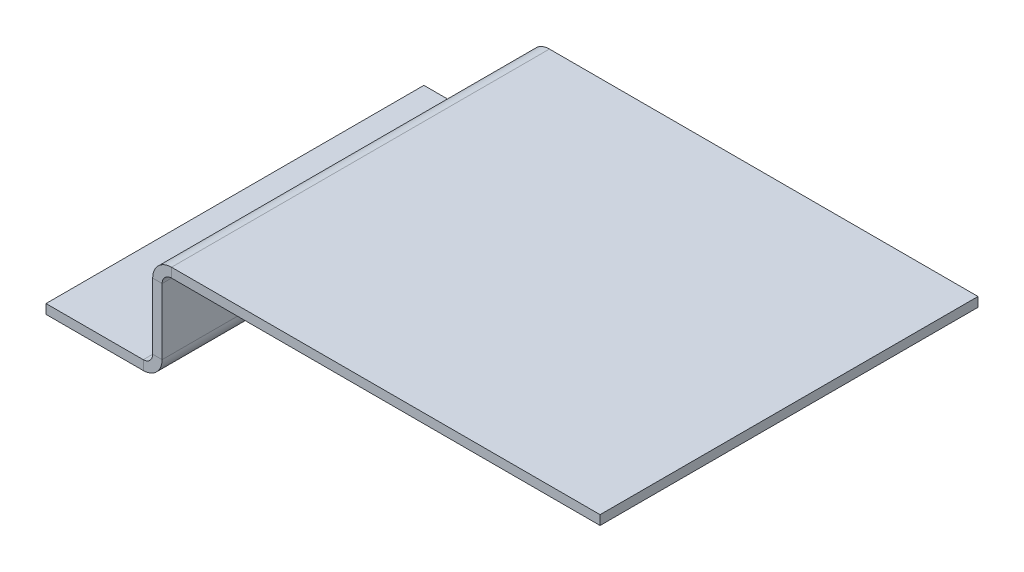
ISO-10303-21;
HEADER;
FILE_DESCRIPTION(('STEP AP214'),'2;1');
FILE_NAME('part.step','',(''),(''),'','','');
FILE_SCHEMA(('AUTOMOTIVE_DESIGN { 1 0 10303 214 1 1 1 1 }'));
ENDSEC;
DATA;
#1=APPLICATION_CONTEXT('core data for automotive mechanical design processes');
#2=APPLICATION_PROTOCOL_DEFINITION('international standard','automotive_design',2000,#1);
#3=PRODUCT_CONTEXT('',#1,'mechanical');
#4=PRODUCT('Part','Part','',(#3));
#5=PRODUCT_RELATED_PRODUCT_CATEGORY('part','',(#4));
#6=PRODUCT_DEFINITION_FORMATION('','',#4);
#7=PRODUCT_DEFINITION_CONTEXT('part definition',#1,'design');
#8=PRODUCT_DEFINITION('design','',#6,#7);
#9=PRODUCT_DEFINITION_SHAPE('','',#8);
#10=(LENGTH_UNIT() NAMED_UNIT(*) SI_UNIT(.MILLI.,.METRE.));
#11=(NAMED_UNIT(*) PLANE_ANGLE_UNIT() SI_UNIT($,.RADIAN.));
#12=(NAMED_UNIT(*) SI_UNIT($,.STERADIAN.) SOLID_ANGLE_UNIT());
#13=UNCERTAINTY_MEASURE_WITH_UNIT(LENGTH_MEASURE(1.E-05),#10,'distance_accuracy_value','');
#14=(GEOMETRIC_REPRESENTATION_CONTEXT(3) GLOBAL_UNCERTAINTY_ASSIGNED_CONTEXT((#13)) GLOBAL_UNIT_ASSIGNED_CONTEXT((#10,
#11,#12)) REPRESENTATION_CONTEXT('',''));
#15=CARTESIAN_POINT('',(0.,0.,0.));
#16=DIRECTION('',(0.,0.,1.));
#17=DIRECTION('',(1.,0.,0.));
#18=AXIS2_PLACEMENT_3D('',#15,#16,#17);
#19=CARTESIAN_POINT('',(24.6513405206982,-21.3637295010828,-80.2293172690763));
#20=DIRECTION('',(1.,0.,0.));
#21=DIRECTION('',(0.,0.,-1.));
#22=AXIS2_PLACEMENT_3D('',#19,#20,#21);
#23=PLANE('',#22);
#24=DIRECTION('',(0.,-1.,0.));
#25=VECTOR('',#24,1.);
#26=CARTESIAN_POINT('',(24.6513405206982,-21.3637295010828,-80.2293172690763));
#27=LINE('',#26,#25);
#28=CARTESIAN_POINT('',(24.6513405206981,18.,-80.2293172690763));
#29=VERTEX_POINT('',#28);
#30=CARTESIAN_POINT('',(24.6513405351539,4.00000000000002,-80.2293172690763));
#31=VERTEX_POINT('',#30);
#32=EDGE_CURVE('E56',#29,#31,#27,.T.);
#33=ORIENTED_EDGE('',*,*,#32,.F.);
#34=DIRECTION('',(0.,0.,1.));
#35=VECTOR('',#34,1.);
#36=CARTESIAN_POINT('',(24.6513405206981,18.,-80.2293172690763));
#37=LINE('',#36,#35);
#38=CARTESIAN_POINT('',(24.6513405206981,18.,0.));
#39=VERTEX_POINT('',#38);
#40=EDGE_CURVE('E48',#29,#39,#37,.T.);
#41=ORIENTED_EDGE('',*,*,#40,.T.);
#42=DIRECTION('',(0.,1.,0.));
#43=VECTOR('',#42,1.);
#44=CARTESIAN_POINT('',(24.6513405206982,-21.3637295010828,0.));
#45=LINE('',#44,#43);
#46=CARTESIAN_POINT('',(24.6513405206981,4.00000000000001,0.));
#47=VERTEX_POINT('',#46);
#48=EDGE_CURVE('E64',#47,#39,#45,.T.);
#49=ORIENTED_EDGE('',*,*,#48,.F.);
#50=DIRECTION('',(0.,0.,1.));
#51=VECTOR('',#50,1.);
#52=CARTESIAN_POINT('',(24.6513405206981,4.00000000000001,-80.2293172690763));
#53=LINE('',#52,#51);
#54=EDGE_CURVE('E237',#31,#47,#53,.T.);
#55=ORIENTED_EDGE('',*,*,#54,.F.);
#56=EDGE_LOOP('',(#33,#41,#49,#55));
#57=FACE_BOUND('',#56,.T.);
#58=ADVANCED_FACE('F39',(#57),#23,.T.);
#59=CARTESIAN_POINT('',(22.6513405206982,-21.3637295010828,0.));
#60=DIRECTION('',(0.,0.,-1.));
#61=DIRECTION('',(0.,-1.,0.));
#62=AXIS2_PLACEMENT_3D('',#59,#60,#61);
#63=PLANE('',#62);
#64=DIRECTION('',(1.,0.,0.));
#65=VECTOR('',#64,1.);
#66=CARTESIAN_POINT('',(22.6513405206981,18.,0.));
#67=LINE('',#66,#65);
#68=CARTESIAN_POINT('',(22.6513405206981,18.,0.));
#69=VERTEX_POINT('',#68);
#70=EDGE_CURVE('E244',#69,#39,#67,.T.);
#71=ORIENTED_EDGE('',*,*,#70,.F.);
#72=DIRECTION('',(0.,1.,0.));
#73=VECTOR('',#72,1.);
#74=CARTESIAN_POINT('',(22.6513405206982,-21.3637295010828,0.));
#75=LINE('',#74,#73);
#76=CARTESIAN_POINT('',(22.6513405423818,4.00000000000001,0.));
#77=VERTEX_POINT('',#76);
#78=EDGE_CURVE('E249',#77,#69,#75,.T.);
#79=ORIENTED_EDGE('',*,*,#78,.F.);
#80=DIRECTION('',(1.,0.,0.));
#81=VECTOR('',#80,1.);
#82=CARTESIAN_POINT('',(22.6513405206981,4.00000000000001,0.));
#83=LINE('',#82,#81);
#84=EDGE_CURVE('E239',#77,#47,#83,.T.);
#85=ORIENTED_EDGE('',*,*,#84,.T.);
#86=ORIENTED_EDGE('',*,*,#48,.T.);
#87=EDGE_LOOP('',(#71,#79,#85,#86));
#88=FACE_BOUND('',#87,.T.);
#89=ADVANCED_FACE('F296',(#88),#63,.F.);
#90=CARTESIAN_POINT('',(22.6513405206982,-21.3637295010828,-80.2293172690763));
#91=DIRECTION('',(0.,0.,1.));
#92=DIRECTION('',(0.,1.,0.));
#93=AXIS2_PLACEMENT_3D('',#90,#91,#92);
#94=PLANE('',#93);
#95=DIRECTION('',(-1.,0.,0.));
#96=VECTOR('',#95,1.);
#97=CARTESIAN_POINT('',(22.6513405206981,18.,-80.2293172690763));
#98=LINE('',#97,#96);
#99=CARTESIAN_POINT('',(22.6513405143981,18.,-80.2293172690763));
#100=VERTEX_POINT('',#99);
#101=EDGE_CURVE('E12',#29,#100,#98,.T.);
#102=ORIENTED_EDGE('',*,*,#101,.F.);
#103=ORIENTED_EDGE('',*,*,#32,.T.);
#104=DIRECTION('',(-1.,0.,0.));
#105=VECTOR('',#104,1.);
#106=CARTESIAN_POINT('',(22.6513405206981,4.00000000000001,-80.2293172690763));
#107=LINE('',#106,#105);
#108=CARTESIAN_POINT('',(22.6513405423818,4.00000000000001,-80.2293172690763));
#109=VERTEX_POINT('',#108);
#110=EDGE_CURVE('E234',#31,#109,#107,.T.);
#111=ORIENTED_EDGE('',*,*,#110,.T.);
#112=DIRECTION('',(0.,-1.,0.));
#113=VECTOR('',#112,1.);
#114=CARTESIAN_POINT('',(22.6513405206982,-21.3637295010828,-80.2293172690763));
#115=LINE('',#114,#113);
#116=EDGE_CURVE('E43',#100,#109,#115,.T.);
#117=ORIENTED_EDGE('',*,*,#116,.F.);
#118=EDGE_LOOP('',(#102,#103,#111,#117));
#119=FACE_BOUND('',#118,.T.);
#120=ADVANCED_FACE('F41',(#119),#94,.F.);
#121=CARTESIAN_POINT('',(22.6513405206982,-21.3637295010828,-80.2293172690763));
#122=DIRECTION('',(1.,0.,0.));
#123=DIRECTION('',(0.,0.,-1.));
#124=AXIS2_PLACEMENT_3D('',#121,#122,#123);
#125=PLANE('',#124);
#126=DIRECTION('',(0.,0.,1.));
#127=VECTOR('',#126,1.);
#128=CARTESIAN_POINT('',(22.6513405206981,18.,-80.2293172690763));
#129=LINE('',#128,#127);
#130=EDGE_CURVE('E241',#100,#69,#129,.T.);
#131=ORIENTED_EDGE('',*,*,#130,.F.);
#132=ORIENTED_EDGE('',*,*,#116,.T.);
#133=DIRECTION('',(0.,0.,1.));
#134=VECTOR('',#133,1.);
#135=CARTESIAN_POINT('',(22.6513405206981,4.00000000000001,-80.2293172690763));
#136=LINE('',#135,#134);
#137=EDGE_CURVE('E231',#109,#77,#136,.T.);
#138=ORIENTED_EDGE('',*,*,#137,.T.);
#139=ORIENTED_EDGE('',*,*,#78,.T.);
#140=EDGE_LOOP('',(#131,#132,#138,#139));
#141=FACE_BOUND('',#140,.T.);
#142=ADVANCED_FACE('F254',(#141),#125,.F.);
#143=CARTESIAN_POINT('',(0.,2.,0.));
#144=DIRECTION('',(1.,0.,0.));
#145=DIRECTION('',(0.,0.,-1.));
#146=AXIS2_PLACEMENT_3D('',#143,#144,#145);
#147=PLANE('',#146);
#148=DIRECTION('',(0.,0.,1.));
#149=VECTOR('',#148,1.);
#150=CARTESIAN_POINT('',(0.,0.,0.));
#151=LINE('',#150,#149);
#152=CARTESIAN_POINT('',(0.,0.,-80.2293172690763));
#153=VERTEX_POINT('',#152);
#154=CARTESIAN_POINT('',(0.,0.,0.));
#155=VERTEX_POINT('',#154);
#156=EDGE_CURVE('E220',#153,#155,#151,.T.);
#157=ORIENTED_EDGE('',*,*,#156,.T.);
#158=DIRECTION('',(0.,-1.,0.));
#159=VECTOR('',#158,1.);
#160=CARTESIAN_POINT('',(0.,2.,0.));
#161=LINE('',#160,#159);
#162=CARTESIAN_POINT('',(0.,2.,0.));
#163=VERTEX_POINT('',#162);
#164=EDGE_CURVE('E202',#163,#155,#161,.T.);
#165=ORIENTED_EDGE('',*,*,#164,.F.);
#166=DIRECTION('',(0.,0.,1.));
#167=VECTOR('',#166,1.);
#168=CARTESIAN_POINT('',(0.,2.,0.));
#169=LINE('',#168,#167);
#170=CARTESIAN_POINT('',(0.,2.,-80.2293172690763));
#171=VERTEX_POINT('',#170);
#172=EDGE_CURVE('E212',#171,#163,#169,.T.);
#173=ORIENTED_EDGE('',*,*,#172,.F.);
#174=DIRECTION('',(0.,-1.,0.));
#175=VECTOR('',#174,1.);
#176=CARTESIAN_POINT('',(0.,2.,-80.2293172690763));
#177=LINE('',#176,#175);
#178=EDGE_CURVE('E217',#171,#153,#177,.T.);
#179=ORIENTED_EDGE('',*,*,#178,.T.);
#180=EDGE_LOOP('',(#157,#165,#173,#179));
#181=FACE_BOUND('',#180,.T.);
#182=ADVANCED_FACE('F285',(#181),#147,.F.);
#183=CARTESIAN_POINT('',(0.,2.,-80.2293172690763));
#184=DIRECTION('',(0.,-1.,0.));
#185=DIRECTION('',(0.,0.,-1.));
#186=AXIS2_PLACEMENT_3D('',#183,#184,#185);
#187=PLANE('',#186);
#188=DIRECTION('',(0.,0.,1.));
#189=VECTOR('',#188,1.);
#190=CARTESIAN_POINT('',(20.6513405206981,2.,-80.2293172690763));
#191=LINE('',#190,#189);
#192=CARTESIAN_POINT('',(20.6513405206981,1.9999999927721,-80.2293172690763));
#193=VERTEX_POINT('',#192);
#194=CARTESIAN_POINT('',(20.6513405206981,2.,0.));
#195=VERTEX_POINT('',#194);
#196=EDGE_CURVE('E195',#193,#195,#191,.T.);
#197=ORIENTED_EDGE('',*,*,#196,.F.);
#198=DIRECTION('',(-1.,0.,0.));
#199=VECTOR('',#198,1.);
#200=CARTESIAN_POINT('',(0.,2.,-80.2293172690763));
#201=LINE('',#200,#199);
#202=EDGE_CURVE('E215',#193,#171,#201,.T.);
#203=ORIENTED_EDGE('',*,*,#202,.T.);
#204=ORIENTED_EDGE('',*,*,#172,.T.);
#205=DIRECTION('',(1.,0.,0.));
#206=VECTOR('',#205,1.);
#207=CARTESIAN_POINT('',(0.,2.,0.));
#208=LINE('',#207,#206);
#209=EDGE_CURVE('E210',#163,#195,#208,.T.);
#210=ORIENTED_EDGE('',*,*,#209,.T.);
#211=EDGE_LOOP('',(#197,#203,#204,#210));
#212=FACE_BOUND('',#211,.T.);
#213=ADVANCED_FACE('F278',(#212),#187,.F.);
#214=CARTESIAN_POINT('',(0.,2.,-80.2293172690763));
#215=DIRECTION('',(0.,0.,1.));
#216=DIRECTION('',(1.,0.,0.));
#217=AXIS2_PLACEMENT_3D('',#214,#215,#216);
#218=PLANE('',#217);
#219=DIRECTION('',(0.,1.,0.));
#220=VECTOR('',#219,1.);
#221=CARTESIAN_POINT('',(20.6513405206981,2.,-80.2293172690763));
#222=LINE('',#221,#220);
#223=CARTESIAN_POINT('',(20.6513405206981,0.,-80.2293172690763));
#224=VERTEX_POINT('',#223);
#225=EDGE_CURVE('E223',#224,#193,#222,.T.);
#226=ORIENTED_EDGE('',*,*,#225,.F.);
#227=DIRECTION('',(-1.,0.,0.));
#228=VECTOR('',#227,1.);
#229=CARTESIAN_POINT('',(0.,0.,-80.2293172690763));
#230=LINE('',#229,#228);
#231=EDGE_CURVE('E208',#224,#153,#230,.T.);
#232=ORIENTED_EDGE('',*,*,#231,.T.);
#233=ORIENTED_EDGE('',*,*,#178,.F.);
#234=ORIENTED_EDGE('',*,*,#202,.F.);
#235=EDGE_LOOP('',(#226,#232,#233,#234));
#236=FACE_BOUND('',#235,.T.);
#237=ADVANCED_FACE('F281',(#236),#218,.F.);
#238=CARTESIAN_POINT('',(0.,0.,-80.2293172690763));
#239=DIRECTION('',(0.,-1.,0.));
#240=DIRECTION('',(0.,0.,-1.));
#241=AXIS2_PLACEMENT_3D('',#238,#239,#240);
#242=PLANE('',#241);
#243=ORIENTED_EDGE('',*,*,#231,.F.);
#244=DIRECTION('',(0.,0.,1.));
#245=VECTOR('',#244,1.);
#246=CARTESIAN_POINT('',(20.6513405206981,0.,-80.2293172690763));
#247=LINE('',#246,#245);
#248=CARTESIAN_POINT('',(20.6513405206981,0.,0.));
#249=VERTEX_POINT('',#248);
#250=EDGE_CURVE('E205',#224,#249,#247,.T.);
#251=ORIENTED_EDGE('',*,*,#250,.T.);
#252=DIRECTION('',(1.,0.,0.));
#253=VECTOR('',#252,1.);
#254=CARTESIAN_POINT('',(0.,0.,0.));
#255=LINE('',#254,#253);
#256=EDGE_CURVE('E200',#155,#249,#255,.T.);
#257=ORIENTED_EDGE('',*,*,#256,.F.);
#258=ORIENTED_EDGE('',*,*,#156,.F.);
#259=EDGE_LOOP('',(#243,#251,#257,#258));
#260=FACE_BOUND('',#259,.T.);
#261=ADVANCED_FACE('F265',(#260),#242,.T.);
#262=CARTESIAN_POINT('',(0.,2.,0.));
#263=DIRECTION('',(0.,0.,-1.));
#264=DIRECTION('',(-1.,0.,0.));
#265=AXIS2_PLACEMENT_3D('',#262,#263,#264);
#266=PLANE('',#265);
#267=DIRECTION('',(0.,-1.,0.));
#268=VECTOR('',#267,1.);
#269=CARTESIAN_POINT('',(20.6513405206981,2.,0.));
#270=LINE('',#269,#268);
#271=EDGE_CURVE('E226',#195,#249,#270,.T.);
#272=ORIENTED_EDGE('',*,*,#271,.F.);
#273=ORIENTED_EDGE('',*,*,#209,.F.);
#274=ORIENTED_EDGE('',*,*,#164,.T.);
#275=ORIENTED_EDGE('',*,*,#256,.T.);
#276=EDGE_LOOP('',(#272,#273,#274,#275));
#277=FACE_BOUND('',#276,.T.);
#278=ADVANCED_FACE('F273',(#277),#266,.F.);
#279=CARTESIAN_POINT('',(20.6513405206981,4.00000001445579,-80.2293172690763));
#280=DIRECTION('',(0.,0.,1.));
#281=DIRECTION('',(1.,0.,0.));
#282=AXIS2_PLACEMENT_3D('',#279,#280,#281);
#283=PLANE('',#282);
#284=ORIENTED_EDGE('',*,*,#110,.F.);
#285=CARTESIAN_POINT('',(20.6513405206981,4.,-80.2293172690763));
#286=DIRECTION('',(0.,0.,-1.));
#287=DIRECTION('',(-1.,0.,0.));
#288=AXIS2_PLACEMENT_3D('',#285,#286,#287);
#289=CIRCLE('',#288,4.00000001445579);
#290=EDGE_CURVE('E185',#31,#224,#289,.T.);
#291=ORIENTED_EDGE('',*,*,#290,.T.);
#292=ORIENTED_EDGE('',*,*,#225,.T.);
#293=CARTESIAN_POINT('',(20.6513405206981,4.00000001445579,-80.2293172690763));
#294=DIRECTION('',(0.,0.,-1.));
#295=DIRECTION('',(-1.,0.,0.));
#296=AXIS2_PLACEMENT_3D('',#293,#294,#295);
#297=CIRCLE('',#296,2.00000002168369);
#298=EDGE_CURVE('E188',#109,#193,#297,.T.);
#299=ORIENTED_EDGE('',*,*,#298,.F.);
#300=EDGE_LOOP('',(#284,#291,#292,#299));
#301=FACE_BOUND('',#300,.T.);
#302=ADVANCED_FACE('F259',(#301),#283,.F.);
#303=CARTESIAN_POINT('',(20.6513405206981,4.00000001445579,0.));
#304=DIRECTION('',(0.,0.,-1.));
#305=DIRECTION('',(-1.,0.,0.));
#306=AXIS2_PLACEMENT_3D('',#303,#304,#305);
#307=PLANE('',#306);
#308=ORIENTED_EDGE('',*,*,#271,.T.);
#309=CARTESIAN_POINT('',(20.6513405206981,4.,0.));
#310=DIRECTION('',(0.,0.,-1.));
#311=DIRECTION('',(-1.,0.,0.));
#312=AXIS2_PLACEMENT_3D('',#309,#310,#311);
#313=CIRCLE('',#312,4.00000001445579);
#314=EDGE_CURVE('E192',#249,#47,#313,.F.);
#315=ORIENTED_EDGE('',*,*,#314,.T.);
#316=ORIENTED_EDGE('',*,*,#84,.F.);
#317=CARTESIAN_POINT('',(20.6513405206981,4.00000001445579,0.));
#318=DIRECTION('',(0.,0.,1.));
#319=DIRECTION('',(1.,0.,0.));
#320=AXIS2_PLACEMENT_3D('',#317,#318,#319);
#321=CIRCLE('',#320,2.00000002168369);
#322=EDGE_CURVE('E191',#195,#77,#321,.T.);
#323=ORIENTED_EDGE('',*,*,#322,.F.);
#324=EDGE_LOOP('',(#308,#315,#316,#323));
#325=FACE_BOUND('',#324,.T.);
#326=ADVANCED_FACE('F271',(#325),#307,.F.);
#327=CARTESIAN_POINT('',(20.6513405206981,4.,40.2778158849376));
#328=DIRECTION('',(0.,0.,-1.));
#329=DIRECTION('',(-1.,0.,0.));
#330=AXIS2_PLACEMENT_3D('',#327,#328,#329);
#331=CYLINDRICAL_SURFACE('',#330,2.00000001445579);
#332=ORIENTED_EDGE('',*,*,#322,.T.);
#333=ORIENTED_EDGE('',*,*,#137,.F.);
#334=ORIENTED_EDGE('',*,*,#298,.T.);
#335=ORIENTED_EDGE('',*,*,#196,.T.);
#336=EDGE_LOOP('',(#332,#333,#334,#335));
#337=FACE_BOUND('',#336,.T.);
#338=ADVANCED_FACE('F276',(#337),#331,.F.);
#339=CARTESIAN_POINT('',(20.6513405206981,4.,40.2778158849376));
#340=DIRECTION('',(0.,0.,-1.));
#341=DIRECTION('',(-1.,0.,0.));
#342=AXIS2_PLACEMENT_3D('',#339,#340,#341);
#343=CYLINDRICAL_SURFACE('',#342,4.00000001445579);
#344=ORIENTED_EDGE('',*,*,#314,.F.);
#345=ORIENTED_EDGE('',*,*,#250,.F.);
#346=ORIENTED_EDGE('',*,*,#290,.F.);
#347=ORIENTED_EDGE('',*,*,#54,.T.);
#348=EDGE_LOOP('',(#344,#345,#346,#347));
#349=FACE_BOUND('',#348,.T.);
#350=ADVANCED_FACE('F263',(#349),#343,.T.);
#351=CARTESIAN_POINT('',(26.651340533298,18.,-80.2293172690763));
#352=DIRECTION('',(0.,0.,-1.));
#353=DIRECTION('',(-1.,0.,0.));
#354=AXIS2_PLACEMENT_3D('',#351,#352,#353);
#355=PLANE('',#354);
#356=DIRECTION('',(0.,1.,0.));
#357=VECTOR('',#356,1.);
#358=CARTESIAN_POINT('',(26.6513405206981,22.,-80.2293172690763));
#359=LINE('',#358,#357);
#360=CARTESIAN_POINT('',(26.6513405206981,20.,-80.2293172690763));
#361=VERTEX_POINT('',#360);
#362=CARTESIAN_POINT('',(26.6513405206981,22.,-80.2293172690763));
#363=VERTEX_POINT('',#362);
#364=EDGE_CURVE('E139',#361,#363,#359,.T.);
#365=ORIENTED_EDGE('',*,*,#364,.F.);
#366=CARTESIAN_POINT('',(26.6513405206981,18.,-80.2293172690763));
#367=DIRECTION('',(0.,0.,-1.));
#368=DIRECTION('',(-1.,0.,0.));
#369=AXIS2_PLACEMENT_3D('',#366,#367,#368);
#370=CIRCLE('',#369,2.00000001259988);
#371=EDGE_CURVE('E159',#361,#29,#370,.F.);
#372=ORIENTED_EDGE('',*,*,#371,.T.);
#373=ORIENTED_EDGE('',*,*,#101,.T.);
#374=CARTESIAN_POINT('',(26.651340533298,18.,-80.2293172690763));
#375=DIRECTION('',(0.,0.,1.));
#376=DIRECTION('',(1.,0.,0.));
#377=AXIS2_PLACEMENT_3D('',#374,#375,#376);
#378=CIRCLE('',#377,4.00000001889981);
#379=EDGE_CURVE('E179',#363,#100,#378,.T.);
#380=ORIENTED_EDGE('',*,*,#379,.F.);
#381=EDGE_LOOP('',(#365,#372,#373,#380));
#382=FACE_BOUND('',#381,.T.);
#383=ADVANCED_FACE('F342',(#382),#355,.T.);
#384=CARTESIAN_POINT('',(26.651340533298,18.,0.));
#385=DIRECTION('',(0.,0.,1.));
#386=DIRECTION('',(1.,0.,0.));
#387=AXIS2_PLACEMENT_3D('',#384,#385,#386);
#388=PLANE('',#387);
#389=ORIENTED_EDGE('',*,*,#70,.T.);
#390=CARTESIAN_POINT('',(26.6513405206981,18.,0.));
#391=DIRECTION('',(0.,0.,-1.));
#392=DIRECTION('',(-1.,0.,0.));
#393=AXIS2_PLACEMENT_3D('',#390,#391,#392);
#394=CIRCLE('',#393,2.00000001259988);
#395=CARTESIAN_POINT('',(26.6513405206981,20.,0.));
#396=VERTEX_POINT('',#395);
#397=EDGE_CURVE('E162',#39,#396,#394,.T.);
#398=ORIENTED_EDGE('',*,*,#397,.T.);
#399=DIRECTION('',(0.,-1.,0.));
#400=VECTOR('',#399,1.);
#401=CARTESIAN_POINT('',(26.6513405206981,22.,0.));
#402=LINE('',#401,#400);
#403=CARTESIAN_POINT('',(26.6513405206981,22.0000000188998,0.));
#404=VERTEX_POINT('',#403);
#405=EDGE_CURVE('E153',#404,#396,#402,.T.);
#406=ORIENTED_EDGE('',*,*,#405,.F.);
#407=CARTESIAN_POINT('',(26.651340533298,18.,0.));
#408=DIRECTION('',(0.,0.,-1.));
#409=DIRECTION('',(-1.,0.,0.));
#410=AXIS2_PLACEMENT_3D('',#407,#408,#409);
#411=CIRCLE('',#410,4.00000001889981);
#412=EDGE_CURVE('E182',#69,#404,#411,.T.);
#413=ORIENTED_EDGE('',*,*,#412,.F.);
#414=EDGE_LOOP('',(#389,#398,#406,#413));
#415=FACE_BOUND('',#414,.T.);
#416=ADVANCED_FACE('F349',(#415),#388,.T.);
#417=CARTESIAN_POINT('',(26.6513405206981,18.,40.2778158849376));
#418=DIRECTION('',(0.,0.,-1.));
#419=DIRECTION('',(-1.,0.,0.));
#420=AXIS2_PLACEMENT_3D('',#417,#418,#419);
#421=CYLINDRICAL_SURFACE('',#420,4.00000001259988);
#422=ORIENTED_EDGE('',*,*,#412,.T.);
#423=DIRECTION('',(0.,0.,1.));
#424=VECTOR('',#423,1.);
#425=CARTESIAN_POINT('',(26.6513405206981,22.,-80.2293172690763));
#426=LINE('',#425,#424);
#427=EDGE_CURVE('E143',#363,#404,#426,.T.);
#428=ORIENTED_EDGE('',*,*,#427,.F.);
#429=ORIENTED_EDGE('',*,*,#379,.T.);
#430=ORIENTED_EDGE('',*,*,#130,.T.);
#431=EDGE_LOOP('',(#422,#428,#429,#430));
#432=FACE_BOUND('',#431,.T.);
#433=ADVANCED_FACE('F357',(#432),#421,.T.);
#434=CARTESIAN_POINT('',(26.6513405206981,18.,40.2778158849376));
#435=DIRECTION('',(0.,0.,-1.));
#436=DIRECTION('',(-1.,0.,0.));
#437=AXIS2_PLACEMENT_3D('',#434,#435,#436);
#438=CYLINDRICAL_SURFACE('',#437,2.00000001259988);
#439=ORIENTED_EDGE('',*,*,#397,.F.);
#440=ORIENTED_EDGE('',*,*,#40,.F.);
#441=ORIENTED_EDGE('',*,*,#371,.F.);
#442=DIRECTION('',(0.,0.,1.));
#443=VECTOR('',#442,1.);
#444=CARTESIAN_POINT('',(26.6513405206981,20.,-80.2293172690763));
#445=LINE('',#444,#443);
#446=EDGE_CURVE('E176',#361,#396,#445,.T.);
#447=ORIENTED_EDGE('',*,*,#446,.T.);
#448=EDGE_LOOP('',(#439,#440,#441,#447));
#449=FACE_BOUND('',#448,.T.);
#450=ADVANCED_FACE('F365',(#449),#438,.F.);
#451=CARTESIAN_POINT('',(117.632262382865,22.,0.));
#452=DIRECTION('',(-1.,0.,0.));
#453=DIRECTION('',(0.,0.,1.));
#454=AXIS2_PLACEMENT_3D('',#451,#452,#453);
#455=PLANE('',#454);
#456=DIRECTION('',(0.,0.,-1.));
#457=VECTOR('',#456,1.);
#458=CARTESIAN_POINT('',(117.632262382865,20.,0.));
#459=LINE('',#458,#457);
#460=CARTESIAN_POINT('',(117.632262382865,20.,0.));
#461=VERTEX_POINT('',#460);
#462=CARTESIAN_POINT('',(117.632262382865,20.,-80.2293172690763));
#463=VERTEX_POINT('',#462);
#464=EDGE_CURVE('E158',#461,#463,#459,.T.);
#465=ORIENTED_EDGE('',*,*,#464,.T.);
#466=DIRECTION('',(0.,-1.,0.));
#467=VECTOR('',#466,1.);
#468=CARTESIAN_POINT('',(117.632262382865,22.,-80.2293172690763));
#469=LINE('',#468,#467);
#470=CARTESIAN_POINT('',(117.632262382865,22.,-80.2293172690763));
#471=VERTEX_POINT('',#470);
#472=EDGE_CURVE('E137',#471,#463,#469,.T.);
#473=ORIENTED_EDGE('',*,*,#472,.F.);
#474=DIRECTION('',(0.,0.,-1.));
#475=VECTOR('',#474,1.);
#476=CARTESIAN_POINT('',(117.632262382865,22.,0.));
#477=LINE('',#476,#475);
#478=CARTESIAN_POINT('',(117.632262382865,22.,0.));
#479=VERTEX_POINT('',#478);
#480=EDGE_CURVE('E147',#479,#471,#477,.T.);
#481=ORIENTED_EDGE('',*,*,#480,.F.);
#482=DIRECTION('',(0.,-1.,0.));
#483=VECTOR('',#482,1.);
#484=CARTESIAN_POINT('',(117.632262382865,22.,0.));
#485=LINE('',#484,#483);
#486=EDGE_CURVE('E144',#479,#461,#485,.T.);
#487=ORIENTED_EDGE('',*,*,#486,.T.);
#488=EDGE_LOOP('',(#465,#473,#481,#487));
#489=FACE_BOUND('',#488,.T.);
#490=ADVANCED_FACE('F156',(#489),#455,.F.);
#491=CARTESIAN_POINT('',(-17.4247779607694,22.,-80.2293172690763));
#492=DIRECTION('',(0.,-1.,0.));
#493=DIRECTION('',(0.,0.,-1.));
#494=AXIS2_PLACEMENT_3D('',#491,#492,#493);
#495=PLANE('',#494);
#496=DIRECTION('',(-1.,0.,0.));
#497=VECTOR('',#496,1.);
#498=CARTESIAN_POINT('',(-17.4247779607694,22.,-80.2293172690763));
#499=LINE('',#498,#497);
#500=EDGE_CURVE('E133',#471,#363,#499,.T.);
#501=ORIENTED_EDGE('',*,*,#500,.T.);
#502=ORIENTED_EDGE('',*,*,#427,.T.);
#503=DIRECTION('',(1.,0.,0.));
#504=VECTOR('',#503,1.);
#505=CARTESIAN_POINT('',(-17.4247779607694,22.,0.));
#506=LINE('',#505,#504);
#507=EDGE_CURVE('E149',#404,#479,#506,.T.);
#508=ORIENTED_EDGE('',*,*,#507,.T.);
#509=ORIENTED_EDGE('',*,*,#480,.T.);
#510=EDGE_LOOP('',(#501,#502,#508,#509));
#511=FACE_BOUND('',#510,.T.);
#512=ADVANCED_FACE('F148',(#511),#495,.F.);
#513=CARTESIAN_POINT('',(-17.4247779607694,22.,0.));
#514=DIRECTION('',(0.,0.,-1.));
#515=DIRECTION('',(-1.,0.,0.));
#516=AXIS2_PLACEMENT_3D('',#513,#514,#515);
#517=PLANE('',#516);
#518=ORIENTED_EDGE('',*,*,#507,.F.);
#519=ORIENTED_EDGE('',*,*,#405,.T.);
#520=DIRECTION('',(1.,0.,0.));
#521=VECTOR('',#520,1.);
#522=CARTESIAN_POINT('',(-17.4247779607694,20.,0.));
#523=LINE('',#522,#521);
#524=EDGE_CURVE('E168',#396,#461,#523,.T.);
#525=ORIENTED_EDGE('',*,*,#524,.T.);
#526=ORIENTED_EDGE('',*,*,#486,.F.);
#527=EDGE_LOOP('',(#518,#519,#525,#526));
#528=FACE_BOUND('',#527,.T.);
#529=ADVANCED_FACE('F386',(#528),#517,.F.);
#530=CARTESIAN_POINT('',(-17.4247779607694,20.,-80.2293172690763));
#531=DIRECTION('',(0.,-1.,0.));
#532=DIRECTION('',(0.,0.,-1.));
#533=AXIS2_PLACEMENT_3D('',#530,#531,#532);
#534=PLANE('',#533);
#535=ORIENTED_EDGE('',*,*,#446,.F.);
#536=DIRECTION('',(-1.,0.,0.));
#537=VECTOR('',#536,1.);
#538=CARTESIAN_POINT('',(-17.4247779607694,20.,-80.2293172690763));
#539=LINE('',#538,#537);
#540=EDGE_CURVE('E164',#463,#361,#539,.T.);
#541=ORIENTED_EDGE('',*,*,#540,.F.);
#542=ORIENTED_EDGE('',*,*,#464,.F.);
#543=ORIENTED_EDGE('',*,*,#524,.F.);
#544=EDGE_LOOP('',(#535,#541,#542,#543));
#545=FACE_BOUND('',#544,.T.);
#546=ADVANCED_FACE('F393',(#545),#534,.T.);
#547=CARTESIAN_POINT('',(-17.4247779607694,22.,-80.2293172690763));
#548=DIRECTION('',(0.,0.,1.));
#549=DIRECTION('',(1.,0.,0.));
#550=AXIS2_PLACEMENT_3D('',#547,#548,#549);
#551=PLANE('',#550);
#552=ORIENTED_EDGE('',*,*,#540,.T.);
#553=ORIENTED_EDGE('',*,*,#364,.T.);
#554=ORIENTED_EDGE('',*,*,#500,.F.);
#555=ORIENTED_EDGE('',*,*,#472,.T.);
#556=EDGE_LOOP('',(#552,#553,#554,#555));
#557=FACE_BOUND('',#556,.T.);
#558=ADVANCED_FACE('F135',(#557),#551,.F.);
#559=CLOSED_SHELL('',(#58,#89,#120,#142,#182,#213,#237,#261,#278,#302,#326,#338,#350,#383,#416,
#433,#450,#490,#512,#529,#546,#558));
#560=MANIFOLD_SOLID_BREP('B2',#559);
#561=ADVANCED_BREP_SHAPE_REPRESENTATION('',(#18,#560),#14);
#562=SHAPE_DEFINITION_REPRESENTATION(#9,#561);
ENDSEC;
END-ISO-10303-21;
